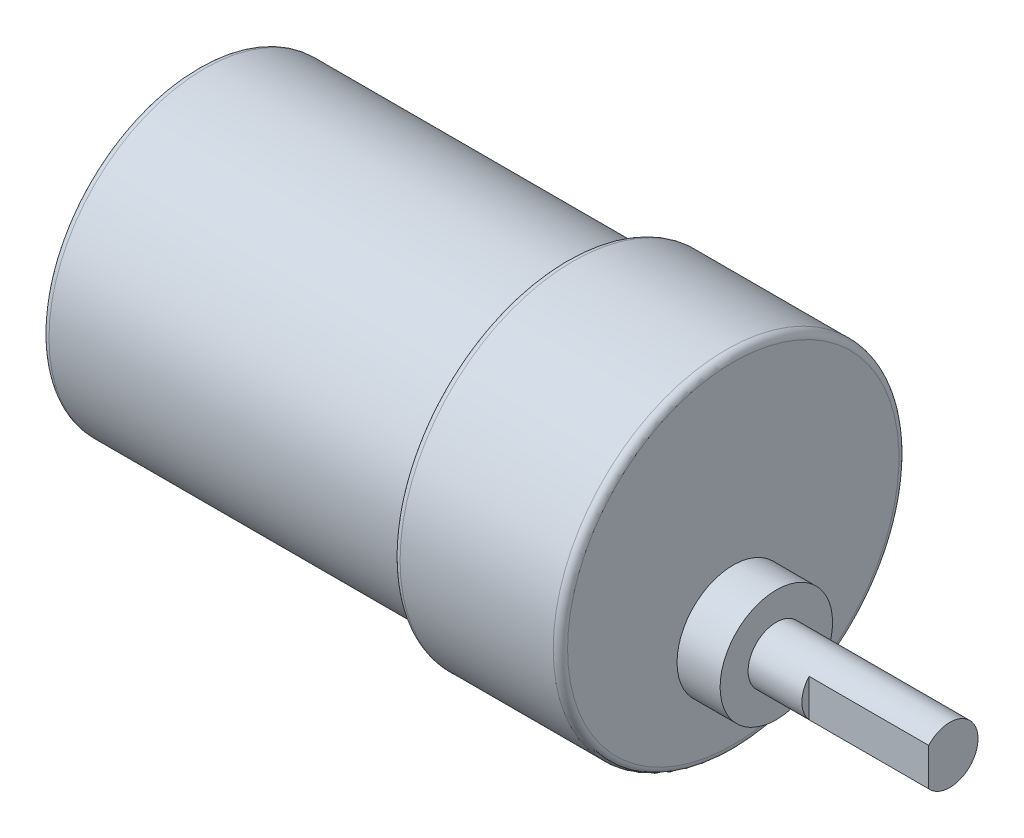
from build123d import *

# Parameters (mm, degrees)
SKETCH2_R           = 5.969
BOSS_EXTRUDE1_DEPTH = 4.572
SKETCH3_R           = 3
BOSS_EXTRUDE2_DEPTH = 18.415
FILLET1_R           = 0.762
SKETCH4_W           = 12.7
SKETCH4_H           = 0.762
CUT_EXTRUDE1_DEPTH  = 84.993147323


with BuildPart() as part:
    # Sketch1 → Revolve1 (revolve)
    with BuildSketch(Plane.XY, mode=Mode.PRIVATE) as revolve1_sk:
        Polygon((0, 3.175), (0, 16.51), (39.116, 16.51), (39.116, 18.3515), (56.896, 18.3515), (56.896, 0), (-2.286, 0), (-2.286, 3.175), align=None)
    revolve(revolve1_sk.sketch.rotate(Axis((-2.286, 0, 0), (1, 0, 0)), 90), axis=Axis((-2.286, 0, 0), (1, 0, 0)))

    # Sketch2 → Boss-Extrude1 (add)
    with BuildSketch(Plane(origin=(56.896, 0, 0), x_dir=(0, 0, -1), z_dir=(1, 0, 0))):
        with Locations(Location((0, -7.0358, 0), (0, 0, 180))):
            Circle(SKETCH2_R)
    extrude(amount=BOSS_EXTRUDE1_DEPTH)

    # Sketch3 → Boss-Extrude2 (add)
    with BuildSketch(Plane(origin=(61.468, 0, 0), x_dir=(0, 0, -1), z_dir=(1, 0, 0))):
        with Locations((0, -7.0358)):
            Circle(SKETCH3_R)
    extrude(amount=BOSS_EXTRUDE2_DEPTH)

    # Fillet1
    fillet1_edges = [part.edges().sort_by_distance(p)[0] for p in [
        (39.116, 0, -18.3515),
        (56.896, 0, -18.3515),
        (-2.286, 0, -3.175),
        (0, 0, -16.51),
    ]]
    fillet(fillet1_edges, radius=FILLET1_R)

    # Sketch4 → Cut-Extrude1 (cut, through all)
    with BuildSketch(Plane(origin=(0, 0, 0), x_dir=(1, 0, 0), z_dir=(0, 1, 0))):
        with Locations((73.533, -2.619)):
            Rectangle(SKETCH4_W, SKETCH4_H)
    extrude(amount=-CUT_EXTRUDE1_DEPTH, mode=Mode.SUBTRACT)


solid = part.part
